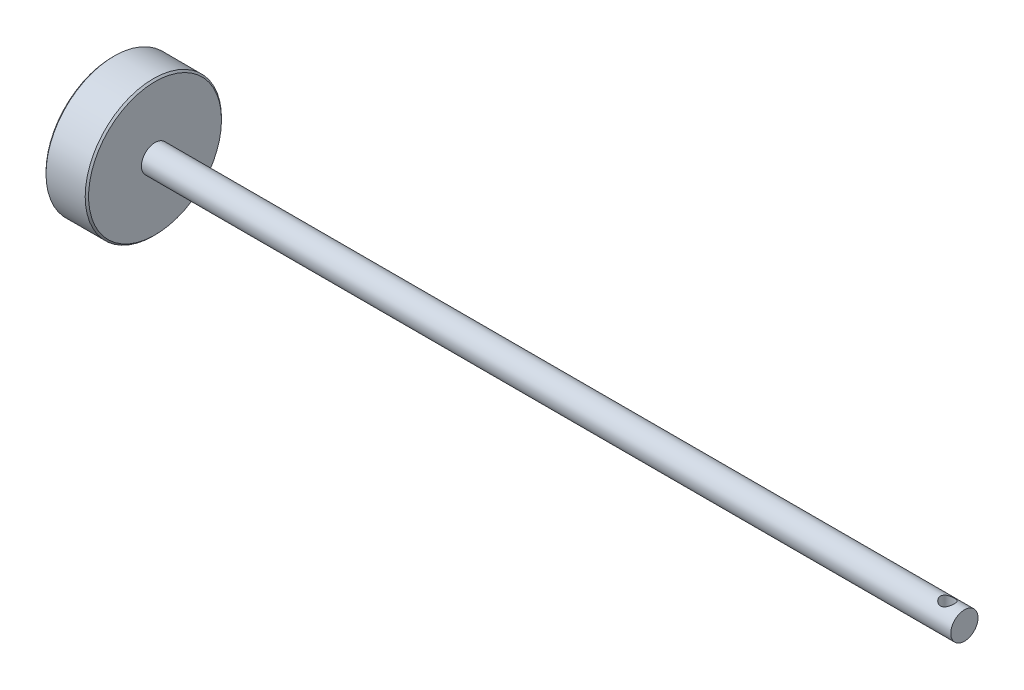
ISO-10303-21;
HEADER;
FILE_DESCRIPTION(('STEP AP214'),'2;1');
FILE_NAME('part.step','',(''),(''),'','','');
FILE_SCHEMA(('AUTOMOTIVE_DESIGN { 1 0 10303 214 1 1 1 1 }'));
ENDSEC;
DATA;
#1=APPLICATION_CONTEXT('core data for automotive mechanical design processes');
#2=APPLICATION_PROTOCOL_DEFINITION('international standard','automotive_design',2000,#1);
#3=PRODUCT_CONTEXT('',#1,'mechanical');
#4=PRODUCT('Part','Part','',(#3));
#5=PRODUCT_RELATED_PRODUCT_CATEGORY('part','',(#4));
#6=PRODUCT_DEFINITION_FORMATION('','',#4);
#7=PRODUCT_DEFINITION_CONTEXT('part definition',#1,'design');
#8=PRODUCT_DEFINITION('design','',#6,#7);
#9=PRODUCT_DEFINITION_SHAPE('','',#8);
#10=(LENGTH_UNIT() NAMED_UNIT(*) SI_UNIT(.MILLI.,.METRE.));
#11=(NAMED_UNIT(*) PLANE_ANGLE_UNIT() SI_UNIT($,.RADIAN.));
#12=(NAMED_UNIT(*) SI_UNIT($,.STERADIAN.) SOLID_ANGLE_UNIT());
#13=UNCERTAINTY_MEASURE_WITH_UNIT(LENGTH_MEASURE(1.E-05),#10,'distance_accuracy_value','');
#14=(GEOMETRIC_REPRESENTATION_CONTEXT(3) GLOBAL_UNCERTAINTY_ASSIGNED_CONTEXT((#13)) GLOBAL_UNIT_ASSIGNED_CONTEXT((#10,
#11,#12)) REPRESENTATION_CONTEXT('',''));
#15=CARTESIAN_POINT('',(0.,0.,0.));
#16=DIRECTION('',(0.,0.,1.));
#17=DIRECTION('',(1.,0.,0.));
#18=AXIS2_PLACEMENT_3D('',#15,#16,#17);
#19=CARTESIAN_POINT('',(-400.,8.,0.));
#20=DIRECTION('',(-1.,0.,0.));
#21=DIRECTION('',(0.,0.,1.));
#22=AXIS2_PLACEMENT_3D('',#19,#20,#21);
#23=CYLINDRICAL_SURFACE('',#22,8.);
#24=CARTESIAN_POINT('',(90.,1.0717967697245,-4.00000000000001));
#25=CARTESIAN_POINT('',(90.1042653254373,1.07179613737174,-3.99999950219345));
#26=CARTESIAN_POINT('',(90.2085399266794,1.06943488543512,-3.9959176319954));
#27=CARTESIAN_POINT('',(90.4162841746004,1.06007827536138,-3.97964472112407));
#28=CARTESIAN_POINT('',(90.5197534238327,1.05308075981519,-3.96744990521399));
#29=CARTESIAN_POINT('',(90.7252108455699,1.03469669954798,-3.93508538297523));
#30=CARTESIAN_POINT('',(90.8271964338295,1.02330327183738,-3.91490316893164));
#31=CARTESIAN_POINT('',(91.0288140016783,0.996540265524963,-3.86682062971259));
#32=CARTESIAN_POINT('',(91.1284449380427,0.981168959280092,-3.83891695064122));
#33=CARTESIAN_POINT('',(91.4216889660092,0.930034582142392,-3.74442772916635));
#34=CARTESIAN_POINT('',(91.610985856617,0.889120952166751,-3.66684915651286));
#35=CARTESIAN_POINT('',(91.973729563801,0.798290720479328,-3.4850607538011));
#36=CARTESIAN_POINT('',(92.1471755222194,0.74837363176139,-3.38084948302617));
#37=CARTESIAN_POINT('',(92.4892084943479,0.640127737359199,-3.13867639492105));
#38=CARTESIAN_POINT('',(92.6562148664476,0.581444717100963,-2.99863981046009));
#39=CARTESIAN_POINT('',(92.9656552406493,0.465113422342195,-2.69298354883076));
#40=CARTESIAN_POINT('',(93.1080769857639,0.407465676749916,-2.52735118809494));
#41=CARTESIAN_POINT('',(93.3049820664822,0.324124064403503,-2.25626437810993));
#42=CARTESIAN_POINT('',(93.3695322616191,0.296050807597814,-2.15870290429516));
#43=CARTESIAN_POINT('',(93.4901044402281,0.242558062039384,-1.95777427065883));
#44=CARTESIAN_POINT('',(93.5461300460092,0.217137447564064,-1.85440960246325));
#45=CARTESIAN_POINT('',(93.6491127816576,0.169678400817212,-1.64251485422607));
#46=CARTESIAN_POINT('',(93.6960700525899,0.147639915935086,-1.53398485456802));
#47=CARTESIAN_POINT('',(93.7803619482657,0.107613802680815,-1.31258580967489));
#48=CARTESIAN_POINT('',(93.8177019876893,0.0896238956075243,-1.19971924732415));
#49=CARTESIAN_POINT('',(93.8800182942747,0.0593542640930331,-0.978622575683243));
#50=CARTESIAN_POINT('',(93.9056821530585,0.0467606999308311,-0.870629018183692));
#51=CARTESIAN_POINT('',(93.9479797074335,0.0259041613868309,-0.652524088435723));
#52=CARTESIAN_POINT('',(93.9646178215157,0.0176390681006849,-0.54241377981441));
#53=CARTESIAN_POINT('',(93.9886558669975,0.00567284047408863,-0.320973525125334));
#54=CARTESIAN_POINT('',(93.9960584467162,0.00197039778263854,-0.209643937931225));
#55=CARTESIAN_POINT('',(94.00153168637,-0.000765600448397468,0.0132971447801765));
#56=CARTESIAN_POINT('',(93.9996029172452,0.000200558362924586,0.124908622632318));
#57=CARTESIAN_POINT('',(93.9870147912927,0.00648639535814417,0.337727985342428));
#58=CARTESIAN_POINT('',(93.9771319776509,0.0114188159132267,0.438993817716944));
#59=CARTESIAN_POINT('',(93.9497367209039,0.0250211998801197,0.64024324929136));
#60=CARTESIAN_POINT('',(93.9322218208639,0.0336923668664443,0.740226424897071));
#61=CARTESIAN_POINT('',(93.8684894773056,0.0650280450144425,1.0371413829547));
#62=CARTESIAN_POINT('',(93.8110721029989,0.0930212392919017,1.23123936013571));
#63=CARTESIAN_POINT('',(93.6676660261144,0.161137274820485,1.60926871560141));
#64=CARTESIAN_POINT('',(93.5812930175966,0.201422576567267,1.79302228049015));
#65=CARTESIAN_POINT('',(93.3829480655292,0.290493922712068,2.14389861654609));
#66=CARTESIAN_POINT('',(93.2709669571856,0.339283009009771,2.31101540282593));
#67=CARTESIAN_POINT('',(93.0124150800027,0.446224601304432,2.64069813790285));
#68=CARTESIAN_POINT('',(92.8635752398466,0.504826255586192,2.80134064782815));
#69=CARTESIAN_POINT('',(92.5416537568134,0.62182508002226,3.09641313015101));
#70=CARTESIAN_POINT('',(92.3685536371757,0.680222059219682,3.23082293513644));
#71=CARTESIAN_POINT('',(91.9893571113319,0.79423887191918,3.47803613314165));
#72=CARTESIAN_POINT('',(91.7818633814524,0.849446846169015,3.58892539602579));
#73=CARTESIAN_POINT('',(91.4565826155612,0.92113074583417,3.72723782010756));
#74=CARTESIAN_POINT('',(91.3457916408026,0.943174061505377,3.76867730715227));
#75=CARTESIAN_POINT('',(91.1202551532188,0.982687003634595,3.84175062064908));
#76=CARTESIAN_POINT('',(91.0055121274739,1.00015944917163,3.873390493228));
#77=CARTESIAN_POINT('',(90.7821713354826,1.02859397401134,3.92431909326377));
#78=CARTESIAN_POINT('',(90.6738013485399,1.03996042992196,3.94438433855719));
#79=CARTESIAN_POINT('',(90.4554190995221,1.05769664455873,3.97551851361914));
#80=CARTESIAN_POINT('',(90.3454077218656,1.06406900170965,3.98659212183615));
#81=CARTESIAN_POINT('',(90.1247074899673,1.07155188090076,3.9995829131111));
#82=CARTESIAN_POINT('',(90.0140189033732,1.07266436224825,4.00150350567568));
#83=CARTESIAN_POINT('',(89.7929433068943,1.06958460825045,3.99616718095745));
#84=CARTESIAN_POINT('',(89.6825562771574,1.06539273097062,3.9889108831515));
#85=CARTESIAN_POINT('',(89.4751306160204,1.05262802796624,3.96663154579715));
#86=CARTESIAN_POINT('',(89.3779567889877,1.04458658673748,3.9525484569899));
#87=CARTESIAN_POINT('',(89.1852680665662,1.02471627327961,3.91737385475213));
#88=CARTESIAN_POINT('',(89.0897537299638,1.01288615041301,3.89628002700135));
#89=CARTESIAN_POINT('',(88.8066319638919,0.972243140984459,3.82280238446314));
#90=CARTESIAN_POINT('',(88.6223085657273,0.938268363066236,3.76020731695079));
#91=CARTESIAN_POINT('',(88.2583254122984,0.858550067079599,3.60658595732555));
#92=CARTESIAN_POINT('',(88.079277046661,0.812334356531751,3.51437713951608));
#93=CARTESIAN_POINT('',(87.7381298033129,0.713755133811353,3.30514737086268));
#94=CARTESIAN_POINT('',(87.5760396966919,0.661388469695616,3.18811367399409));
#95=CARTESIAN_POINT('',(87.2520868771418,0.548481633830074,2.91535761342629));
#96=CARTESIAN_POINT('',(87.0928284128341,0.487743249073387,2.75661800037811));
#97=CARTESIAN_POINT('',(86.8023340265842,0.370624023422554,2.41358105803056));
#98=CARTESIAN_POINT('',(86.6711075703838,0.314244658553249,2.229275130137));
#99=CARTESIAN_POINT('',(86.4967922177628,0.236644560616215,1.93419225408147));
#100=CARTESIAN_POINT('',(86.4418699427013,0.211656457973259,1.83122945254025));
#101=CARTESIAN_POINT('',(86.3409944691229,0.165058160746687,1.62028527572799));
#102=CARTESIAN_POINT('',(86.2950372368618,0.143446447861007,1.51230618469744));
#103=CARTESIAN_POINT('',(86.2126256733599,0.104248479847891,1.29213403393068));
#104=CARTESIAN_POINT('',(86.1761668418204,0.0866603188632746,1.17994299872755));
#105=CARTESIAN_POINT('',(86.1131927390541,0.0560392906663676,0.952197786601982));
#106=CARTESIAN_POINT('',(86.0866762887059,0.0430058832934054,0.836644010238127));
#107=CARTESIAN_POINT('',(86.0459279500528,0.0228825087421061,0.613942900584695));
#108=CARTESIAN_POINT('',(86.0307905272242,0.0153561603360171,0.506999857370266));
#109=CARTESIAN_POINT('',(86.0092078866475,0.00460550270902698,0.291983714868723));
#110=CARTESIAN_POINT('',(86.002765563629,0.00138262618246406,0.183910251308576));
#111=CARTESIAN_POINT('',(85.9986698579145,-0.000664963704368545,-0.0323692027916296));
#112=CARTESIAN_POINT('',(86.0010103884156,0.000507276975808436,-0.140575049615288));
#113=CARTESIAN_POINT('',(86.014437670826,0.00721115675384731,-0.356345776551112));
#114=CARTESIAN_POINT('',(86.0255276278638,0.012744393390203,-0.463910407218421));
#115=CARTESIAN_POINT('',(86.0552939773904,0.0275129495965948,-0.670402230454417));
#116=CARTESIAN_POINT('',(86.0734178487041,0.036478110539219,-0.769428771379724));
#117=CARTESIAN_POINT('',(86.1169699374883,0.0578611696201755,-0.965494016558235));
#118=CARTESIAN_POINT('',(86.142400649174,0.0702802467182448,-1.06253202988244));
#119=CARTESIAN_POINT('',(86.2292865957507,0.112309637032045,-1.34967669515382));
#120=CARTESIAN_POINT('',(86.30136154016,0.146705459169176,-1.535990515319));
#121=CARTESIAN_POINT('',(86.4749137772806,0.226964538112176,-1.90172389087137));
#122=CARTESIAN_POINT('',(86.5775167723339,0.273255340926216,-2.08050775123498));
#123=CARTESIAN_POINT('',(86.8078322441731,0.372474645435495,-2.41909138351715));
#124=CARTESIAN_POINT('',(86.9355562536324,0.425406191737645,-2.57888238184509));
#125=CARTESIAN_POINT('',(87.227180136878,0.538853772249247,-2.8916543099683));
#126=CARTESIAN_POINT('',(87.393415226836,0.599600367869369,-3.04237488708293));
#127=CARTESIAN_POINT('',(87.7498376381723,0.71748463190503,-3.31466901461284));
#128=CARTESIAN_POINT('',(87.9400459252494,0.774619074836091,-3.43621677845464));
#129=CARTESIAN_POINT('',(88.2433757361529,0.853269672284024,-3.59554085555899));
#130=CARTESIAN_POINT('',(88.3493010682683,0.878650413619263,-3.64540546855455));
#131=CARTESIAN_POINT('',(88.5658043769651,0.925696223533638,-3.7358834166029));
#132=CARTESIAN_POINT('',(88.6763799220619,0.947363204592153,-3.77650151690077));
#133=CARTESIAN_POINT('',(88.9011262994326,0.986063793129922,-3.8479016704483));
#134=CARTESIAN_POINT('',(89.015287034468,1.00310930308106,-3.87870902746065));
#135=CARTESIAN_POINT('',(89.2464737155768,1.03188172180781,-3.93016568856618));
#136=CARTESIAN_POINT('',(89.3634975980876,1.04361234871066,-3.95082209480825));
#137=CARTESIAN_POINT('',(89.5671983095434,1.05881967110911,-3.97745846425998));
#138=CARTESIAN_POINT('',(89.6534593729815,1.06367424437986,-3.98590343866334));
#139=CARTESIAN_POINT('',(89.8264781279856,1.07016316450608,-3.99717460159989));
#140=CARTESIAN_POINT('',(89.9132358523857,1.07179729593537,-4.00000041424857));
#141=CARTESIAN_POINT('',(90.,1.0717967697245,-4.00000000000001));
#142=B_SPLINE_CURVE_WITH_KNOTS('',3,(#24,#25,#26,#27,#28,#29,#30,#31,#32,#33,#34,#35,#36,#37,
#38,#39,#40,#41,#42,#43,#44,#45,#46,#47,#48,#49,#50,#51,#52,#53,#54,#55,#56,#57,#58,#59,#60,#61,
#62,#63,#64,#65,#66,#67,#68,#69,#70,#71,#72,#73,#74,#75,#76,#77,#78,#79,#80,#81,#82,#83,#84,#85,
#86,#87,#88,#89,#90,#91,#92,#93,#94,#95,#96,#97,#98,#99,#100,#101,#102,#103,#104,#105,#106,#107,
#108,#109,#110,#111,#112,#113,#114,#115,#116,#117,#118,#119,#120,#121,#122,#123,#124,#125,#126,
#127,#128,#129,#130,#131,#132,#133,#134,#135,#136,#137,#138,#139,#140,#141),.UNSPECIFIED.,.T.,
.F.,(4,2,2,2,2,2,2,2,2,2,2,2,2,2,2,2,2,2,2,2,2,2,2,2,2,2,2,2,2,2,2,2,2,2,2,2,2,2,2,2,2,2,2,2,2,
2,2,2,2,2,2,2,2,2,2,2,2,2,4),(0.,0.312705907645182,0.625557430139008,0.938900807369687,
1.25238050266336,1.8753233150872,2.49829983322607,3.1726581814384,3.84735177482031,
4.20786878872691,4.56823217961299,4.92858996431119,5.28874441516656,5.62343001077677,
5.95795161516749,6.29237727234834,6.62678246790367,6.93200651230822,7.2373288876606,
7.84737748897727,8.46586637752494,9.08457696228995,9.76177264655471,10.4394869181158,
11.160238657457,11.5207615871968,11.8810616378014,12.212984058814,12.5447336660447,
12.8763596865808,13.2079633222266,13.5031682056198,13.7984706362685,14.38866539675,
15.006195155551,15.6240427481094,16.319773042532,17.0157378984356,17.3733524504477,
17.7308057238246,18.0880893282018,18.4453305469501,18.7697157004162,19.0942088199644,
19.4184770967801,19.7428642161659,20.0457160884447,20.3486714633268,20.9540518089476,
21.585324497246,22.2168876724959,22.9113041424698,23.6063321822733,23.9652997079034,
24.3240818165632,24.6819309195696,25.0395292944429,25.2997293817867,25.5599468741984),.UNSPECIFIED.);
#143=CARTESIAN_POINT('',(90.,1.0717967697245,-4.00000000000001));
#144=VERTEX_POINT('',#143);
#145=EDGE_CURVE('E68',#144,#144,#142,.T.);
#146=ORIENTED_EDGE('',*,*,#145,.F.);
#147=EDGE_LOOP('',(#146));
#148=FACE_BOUND('',#147,.T.);
#149=CARTESIAN_POINT('',(100.,8.,0.));
#150=DIRECTION('',(-1.,0.,0.));
#151=DIRECTION('',(0.,0.,1.));
#152=AXIS2_PLACEMENT_3D('',#149,#150,#151);
#153=CIRCLE('',#152,8.);
#154=CARTESIAN_POINT('',(100.,8.,8.));
#155=VERTEX_POINT('',#154);
#156=EDGE_CURVE('E58',#155,#155,#153,.T.);
#157=ORIENTED_EDGE('',*,*,#156,.T.);
#158=EDGE_LOOP('',(#157));
#159=FACE_BOUND('',#158,.T.);
#160=CARTESIAN_POINT('',(-375.,8.,0.));
#161=DIRECTION('',(-1.,0.,0.));
#162=DIRECTION('',(0.,0.,1.));
#163=AXIS2_PLACEMENT_3D('',#160,#161,#162);
#164=CIRCLE('',#163,8.);
#165=CARTESIAN_POINT('',(-375.,8.,8.));
#166=VERTEX_POINT('',#165);
#167=EDGE_CURVE('E63',#166,#166,#164,.T.);
#168=ORIENTED_EDGE('',*,*,#167,.F.);
#169=EDGE_LOOP('',(#168));
#170=FACE_BOUND('',#169,.T.);
#171=CARTESIAN_POINT('',(90.,14.9282032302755,-4.00000000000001));
#172=CARTESIAN_POINT('',(89.8957346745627,14.9282038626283,-3.99999950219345));
#173=CARTESIAN_POINT('',(89.7914600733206,14.9305651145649,-3.9959176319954));
#174=CARTESIAN_POINT('',(89.5837158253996,14.9399217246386,-3.97964472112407));
#175=CARTESIAN_POINT('',(89.4802465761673,14.9469192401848,-3.96744990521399));
#176=CARTESIAN_POINT('',(89.2747891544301,14.965303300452,-3.93508538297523));
#177=CARTESIAN_POINT('',(89.1728035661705,14.9766967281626,-3.91490316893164));
#178=CARTESIAN_POINT('',(88.9711859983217,15.003459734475,-3.86682062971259));
#179=CARTESIAN_POINT('',(88.8715550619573,15.0188310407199,-3.83891695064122));
#180=CARTESIAN_POINT('',(88.5783110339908,15.0699654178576,-3.74442772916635));
#181=CARTESIAN_POINT('',(88.389014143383,15.1108790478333,-3.66684915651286));
#182=CARTESIAN_POINT('',(88.026270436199,15.2017092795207,-3.4850607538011));
#183=CARTESIAN_POINT('',(87.8528244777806,15.2516263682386,-3.38084948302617));
#184=CARTESIAN_POINT('',(87.5107915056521,15.3598722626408,-3.13867639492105));
#185=CARTESIAN_POINT('',(87.3437851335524,15.418555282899,-2.99863981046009));
#186=CARTESIAN_POINT('',(87.0343447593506,15.5348865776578,-2.69298354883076));
#187=CARTESIAN_POINT('',(86.8919230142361,15.5925343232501,-2.52735118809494));
#188=CARTESIAN_POINT('',(86.6950179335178,15.6758759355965,-2.25626437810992));
#189=CARTESIAN_POINT('',(86.6304677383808,15.7039491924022,-2.15870290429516));
#190=CARTESIAN_POINT('',(86.5098955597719,15.7574419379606,-1.95777427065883));
#191=CARTESIAN_POINT('',(86.4538699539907,15.7828625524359,-1.85440960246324));
#192=CARTESIAN_POINT('',(86.3508872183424,15.8303215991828,-1.64251485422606));
#193=CARTESIAN_POINT('',(86.3039299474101,15.8523600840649,-1.53398485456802));
#194=CARTESIAN_POINT('',(86.2196380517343,15.8923861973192,-1.31258580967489));
#195=CARTESIAN_POINT('',(86.1822980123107,15.9103761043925,-1.19971924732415));
#196=CARTESIAN_POINT('',(86.1199817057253,15.940645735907,-0.978622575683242));
#197=CARTESIAN_POINT('',(86.0943178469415,15.9532393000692,-0.870629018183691));
#198=CARTESIAN_POINT('',(86.0520202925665,15.9740958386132,-0.652524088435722));
#199=CARTESIAN_POINT('',(86.0353821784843,15.9823609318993,-0.542413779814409));
#200=CARTESIAN_POINT('',(86.0113441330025,15.9943271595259,-0.320973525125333));
#201=CARTESIAN_POINT('',(86.0039415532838,15.9980296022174,-0.209643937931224));
#202=CARTESIAN_POINT('',(85.99846831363,16.0007656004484,0.0132971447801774));
#203=CARTESIAN_POINT('',(86.0003970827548,15.9997994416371,0.124908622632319));
#204=CARTESIAN_POINT('',(86.0129852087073,15.9935136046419,0.337727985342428));
#205=CARTESIAN_POINT('',(86.0228680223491,15.9885811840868,0.438993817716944));
#206=CARTESIAN_POINT('',(86.0502632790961,15.9749788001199,0.64024324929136));
#207=CARTESIAN_POINT('',(86.0677781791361,15.9663076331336,0.740226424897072));
#208=CARTESIAN_POINT('',(86.1315105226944,15.9349719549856,1.0371413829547));
#209=CARTESIAN_POINT('',(86.1889278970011,15.9069787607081,1.23123936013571));
#210=CARTESIAN_POINT('',(86.3323339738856,15.8388627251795,1.60926871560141));
#211=CARTESIAN_POINT('',(86.4187069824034,15.7985774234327,1.79302228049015));
#212=CARTESIAN_POINT('',(86.6170519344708,15.7095060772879,2.14389861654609));
#213=CARTESIAN_POINT('',(86.7290330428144,15.6607169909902,2.31101540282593));
#214=CARTESIAN_POINT('',(86.9875849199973,15.5537753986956,2.64069813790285));
#215=CARTESIAN_POINT('',(87.1364247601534,15.4951737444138,2.80134064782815));
#216=CARTESIAN_POINT('',(87.4583462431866,15.3781749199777,3.09641313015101));
#217=CARTESIAN_POINT('',(87.6314463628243,15.3197779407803,3.23082293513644));
#218=CARTESIAN_POINT('',(88.0106428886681,15.2057611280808,3.47803613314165));
#219=CARTESIAN_POINT('',(88.2181366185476,15.150553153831,3.58892539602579));
#220=CARTESIAN_POINT('',(88.5434173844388,15.0788692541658,3.72723782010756));
#221=CARTESIAN_POINT('',(88.6542083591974,15.0568259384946,3.76867730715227));
#222=CARTESIAN_POINT('',(88.8797448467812,15.0173129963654,3.84175062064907));
#223=CARTESIAN_POINT('',(88.9944878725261,14.9998405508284,3.873390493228));
#224=CARTESIAN_POINT('',(89.2178286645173,14.9714060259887,3.92431909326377));
#225=CARTESIAN_POINT('',(89.32619865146,14.960039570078,3.94438433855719));
#226=CARTESIAN_POINT('',(89.5445809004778,14.9423033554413,3.97551851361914));
#227=CARTESIAN_POINT('',(89.6545922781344,14.9359309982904,3.98659212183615));
#228=CARTESIAN_POINT('',(89.8752925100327,14.9284481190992,3.99958291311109));
#229=CARTESIAN_POINT('',(89.9859810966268,14.9273356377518,4.00150350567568));
#230=CARTESIAN_POINT('',(90.2070566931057,14.9304153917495,3.99616718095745));
#231=CARTESIAN_POINT('',(90.3174437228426,14.9346072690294,3.9889108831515));
#232=CARTESIAN_POINT('',(90.5248693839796,14.9473719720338,3.96663154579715));
#233=CARTESIAN_POINT('',(90.6220432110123,14.9554134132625,3.9525484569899));
#234=CARTESIAN_POINT('',(90.8147319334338,14.9752837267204,3.91737385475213));
#235=CARTESIAN_POINT('',(90.9102462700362,14.987113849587,3.89628002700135));
#236=CARTESIAN_POINT('',(91.1933680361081,15.0277568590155,3.82280238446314));
#237=CARTESIAN_POINT('',(91.3776914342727,15.0617316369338,3.76020731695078));
#238=CARTESIAN_POINT('',(91.7416745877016,15.1414499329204,3.60658595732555));
#239=CARTESIAN_POINT('',(91.920722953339,15.1876656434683,3.51437713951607));
#240=CARTESIAN_POINT('',(92.2618701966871,15.2862448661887,3.30514737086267));
#241=CARTESIAN_POINT('',(92.4239603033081,15.3386115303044,3.18811367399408));
#242=CARTESIAN_POINT('',(92.7479131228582,15.4515183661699,2.91535761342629));
#243=CARTESIAN_POINT('',(92.9071715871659,15.5122567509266,2.7566180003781));
#244=CARTESIAN_POINT('',(93.1976659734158,15.6293759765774,2.41358105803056));
#245=CARTESIAN_POINT('',(93.3288924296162,15.6857553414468,2.22927513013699));
#246=CARTESIAN_POINT('',(93.5032077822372,15.7633554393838,1.93419225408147));
#247=CARTESIAN_POINT('',(93.5581300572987,15.7883435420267,1.83122945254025));
#248=CARTESIAN_POINT('',(93.659005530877,15.8349418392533,1.62028527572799));
#249=CARTESIAN_POINT('',(93.7049627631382,15.856553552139,1.51230618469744));
#250=CARTESIAN_POINT('',(93.7873743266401,15.8957515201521,1.29213403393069));
#251=CARTESIAN_POINT('',(93.8238331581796,15.9133396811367,1.17994299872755));
#252=CARTESIAN_POINT('',(93.8868072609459,15.9439607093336,0.952197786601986));
#253=CARTESIAN_POINT('',(93.9133237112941,15.9569941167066,0.836644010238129));
#254=CARTESIAN_POINT('',(93.9540720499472,15.9771174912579,0.613942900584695));
#255=CARTESIAN_POINT('',(93.9692094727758,15.984643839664,0.506999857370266));
#256=CARTESIAN_POINT('',(93.9907921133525,15.995394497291,0.291983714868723));
#257=CARTESIAN_POINT('',(93.997234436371,15.9986173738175,0.183910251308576));
#258=CARTESIAN_POINT('',(94.0013301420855,16.0006649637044,-0.0323692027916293));
#259=CARTESIAN_POINT('',(93.9989896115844,15.9994927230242,-0.140575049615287));
#260=CARTESIAN_POINT('',(93.985562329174,15.9927888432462,-0.356345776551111));
#261=CARTESIAN_POINT('',(93.9744723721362,15.9872556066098,-0.463910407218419));
#262=CARTESIAN_POINT('',(93.9447060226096,15.9724870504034,-0.670402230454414));
#263=CARTESIAN_POINT('',(93.9265821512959,15.9635218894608,-0.769428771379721));
#264=CARTESIAN_POINT('',(93.8830300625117,15.9421388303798,-0.965494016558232));
#265=CARTESIAN_POINT('',(93.857599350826,15.9297197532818,-1.06253202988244));
#266=CARTESIAN_POINT('',(93.7707134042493,15.887690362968,-1.34967669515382));
#267=CARTESIAN_POINT('',(93.69863845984,15.8532945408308,-1.535990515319));
#268=CARTESIAN_POINT('',(93.5250862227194,15.7730354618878,-1.90172389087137));
#269=CARTESIAN_POINT('',(93.422483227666,15.7267446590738,-2.08050775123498));
#270=CARTESIAN_POINT('',(93.1921677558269,15.6275253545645,-2.41909138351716));
#271=CARTESIAN_POINT('',(93.0644437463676,15.5745938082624,-2.57888238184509));
#272=CARTESIAN_POINT('',(92.772819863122,15.4611462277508,-2.8916543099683));
#273=CARTESIAN_POINT('',(92.606584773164,15.4003996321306,-3.04237488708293));
#274=CARTESIAN_POINT('',(92.2501623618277,15.282515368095,-3.31466901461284));
#275=CARTESIAN_POINT('',(92.0599540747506,15.2253809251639,-3.43621677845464));
#276=CARTESIAN_POINT('',(91.756624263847,15.146730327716,-3.59554085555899));
#277=CARTESIAN_POINT('',(91.6506989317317,15.1213495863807,-3.64540546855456));
#278=CARTESIAN_POINT('',(91.4341956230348,15.0743037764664,-3.73588341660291));
#279=CARTESIAN_POINT('',(91.3236200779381,15.0526367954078,-3.77650151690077));
#280=CARTESIAN_POINT('',(91.0988737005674,15.0139362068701,-3.8479016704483));
#281=CARTESIAN_POINT('',(90.984712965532,14.9968906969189,-3.87870902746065));
#282=CARTESIAN_POINT('',(90.7535262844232,14.9681182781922,-3.93016568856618));
#283=CARTESIAN_POINT('',(90.6365024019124,14.9563876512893,-3.95082209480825));
#284=CARTESIAN_POINT('',(90.4328016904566,14.9411803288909,-3.97745846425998));
#285=CARTESIAN_POINT('',(90.3465406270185,14.9363257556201,-3.98590343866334));
#286=CARTESIAN_POINT('',(90.1735218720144,14.9298368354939,-3.99717460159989));
#287=CARTESIAN_POINT('',(90.0867641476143,14.9282027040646,-4.00000041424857));
#288=CARTESIAN_POINT('',(90.,14.9282032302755,-4.00000000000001));
#289=B_SPLINE_CURVE_WITH_KNOTS('',3,(#171,#172,#173,#174,#175,#176,#177,#178,#179,#180,#181,
#182,#183,#184,#185,#186,#187,#188,#189,#190,#191,#192,#193,#194,#195,#196,#197,#198,#199,#200,
#201,#202,#203,#204,#205,#206,#207,#208,#209,#210,#211,#212,#213,#214,#215,#216,#217,#218,#219,
#220,#221,#222,#223,#224,#225,#226,#227,#228,#229,#230,#231,#232,#233,#234,#235,#236,#237,#238,
#239,#240,#241,#242,#243,#244,#245,#246,#247,#248,#249,#250,#251,#252,#253,#254,#255,#256,#257,
#258,#259,#260,#261,#262,#263,#264,#265,#266,#267,#268,#269,#270,#271,#272,#273,#274,#275,#276,
#277,#278,#279,#280,#281,#282,#283,#284,#285,#286,#287,#288),.UNSPECIFIED.,.T.,.F.,(4,2,2,2,2,2,
2,2,2,2,2,2,2,2,2,2,2,2,2,2,2,2,2,2,2,2,2,2,2,2,2,2,2,2,2,2,2,2,2,2,2,2,2,2,2,2,2,2,2,2,2,2,2,2,
2,2,2,2,4),(0.,0.312705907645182,0.625557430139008,0.938900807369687,1.25238050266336,
1.8753233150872,2.49829983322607,3.1726581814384,3.84735177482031,4.20786878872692,
4.568232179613,4.92858996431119,5.28874441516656,5.62343001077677,5.95795161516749,
6.29237727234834,6.62678246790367,6.93200651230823,7.23732888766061,7.84737748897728,
8.46586637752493,9.08457696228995,9.76177264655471,10.4394869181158,11.160238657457,
11.5207615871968,11.8810616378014,12.212984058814,12.5447336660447,12.8763596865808,
13.2079633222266,13.5031682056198,13.7984706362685,14.3886653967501,15.006195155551,
15.6240427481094,16.319773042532,17.0157378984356,17.3733524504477,17.7308057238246,
18.0880893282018,18.4453305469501,18.7697157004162,19.0942088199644,19.4184770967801,
19.7428642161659,20.0457160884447,20.3486714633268,20.9540518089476,21.585324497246,
22.2168876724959,22.9113041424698,23.6063321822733,23.9652997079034,24.3240818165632,
24.6819309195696,25.0395292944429,25.2997293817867,25.5599468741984),.UNSPECIFIED.);
#290=CARTESIAN_POINT('',(90.,14.9282032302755,-4.00000000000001));
#291=VERTEX_POINT('',#290);
#292=EDGE_CURVE('E67',#291,#291,#289,.T.);
#293=ORIENTED_EDGE('',*,*,#292,.F.);
#294=EDGE_LOOP('',(#293));
#295=FACE_BOUND('',#294,.T.);
#296=ADVANCED_FACE('F39',(#148,#159,#170,#295),#23,.T.);
#297=CARTESIAN_POINT('',(100.,0.,0.));
#298=DIRECTION('',(1.,0.,0.));
#299=DIRECTION('',(0.,0.,-1.));
#300=AXIS2_PLACEMENT_3D('',#297,#298,#299);
#301=PLANE('',#300);
#302=ORIENTED_EDGE('',*,*,#156,.F.);
#303=EDGE_LOOP('',(#302));
#304=FACE_BOUND('',#303,.T.);
#305=ADVANCED_FACE('F93',(#304),#301,.T.);
#306=CARTESIAN_POINT('',(-375.,0.,0.));
#307=DIRECTION('',(1.,0.,0.));
#308=DIRECTION('',(0.,0.,-1.));
#309=AXIS2_PLACEMENT_3D('',#306,#307,#308);
#310=PLANE('',#309);
#311=CARTESIAN_POINT('',(-375.,8.,0.));
#312=DIRECTION('',(1.,0.,0.));
#313=DIRECTION('',(0.,0.,-1.));
#314=AXIS2_PLACEMENT_3D('',#311,#312,#313);
#315=CIRCLE('',#314,39.);
#316=CARTESIAN_POINT('',(-375.,8.,-39.));
#317=VERTEX_POINT('',#316);
#318=EDGE_CURVE('E46',#317,#317,#315,.T.);
#319=ORIENTED_EDGE('',*,*,#318,.T.);
#320=EDGE_LOOP('',(#319));
#321=FACE_BOUND('',#320,.T.);
#322=ORIENTED_EDGE('',*,*,#167,.T.);
#323=EDGE_LOOP('',(#322));
#324=FACE_BOUND('',#323,.T.);
#325=ADVANCED_FACE('F89',(#321,#324),#310,.T.);
#326=CARTESIAN_POINT('',(-400.,8.,0.));
#327=DIRECTION('',(-1.,0.,0.));
#328=DIRECTION('',(0.,0.,1.));
#329=AXIS2_PLACEMENT_3D('',#326,#327,#328);
#330=CYLINDRICAL_SURFACE('',#329,40.);
#331=CARTESIAN_POINT('',(-376.,8.,0.));
#332=DIRECTION('',(1.,0.,0.));
#333=DIRECTION('',(0.,0.,-1.));
#334=AXIS2_PLACEMENT_3D('',#331,#332,#333);
#335=CIRCLE('',#334,40.);
#336=CARTESIAN_POINT('',(-376.,8.,-40.));
#337=VERTEX_POINT('',#336);
#338=EDGE_CURVE('E50',#337,#337,#335,.F.);
#339=ORIENTED_EDGE('',*,*,#338,.T.);
#340=EDGE_LOOP('',(#339));
#341=FACE_BOUND('',#340,.T.);
#342=CARTESIAN_POINT('',(-399.,8.,0.));
#343=DIRECTION('',(-1.,0.,0.));
#344=DIRECTION('',(0.,0.,1.));
#345=AXIS2_PLACEMENT_3D('',#342,#343,#344);
#346=CIRCLE('',#345,40.);
#347=CARTESIAN_POINT('',(-399.,8.,40.));
#348=VERTEX_POINT('',#347);
#349=EDGE_CURVE('E54',#348,#348,#346,.F.);
#350=ORIENTED_EDGE('',*,*,#349,.T.);
#351=EDGE_LOOP('',(#350));
#352=FACE_BOUND('',#351,.T.);
#353=ADVANCED_FACE('F86',(#341,#352),#330,.T.);
#354=CARTESIAN_POINT('',(-400.,8.,0.));
#355=DIRECTION('',(-1.,0.,0.));
#356=DIRECTION('',(0.,0.,1.));
#357=AXIS2_PLACEMENT_3D('',#354,#355,#356);
#358=PLANE('',#357);
#359=CARTESIAN_POINT('',(-400.,8.,0.));
#360=DIRECTION('',(-1.,0.,0.));
#361=DIRECTION('',(0.,0.,1.));
#362=AXIS2_PLACEMENT_3D('',#359,#360,#361);
#363=CIRCLE('',#362,39.);
#364=CARTESIAN_POINT('',(-400.,8.,39.));
#365=VERTEX_POINT('',#364);
#366=EDGE_CURVE('E11',#365,#365,#363,.T.);
#367=ORIENTED_EDGE('',*,*,#366,.T.);
#368=EDGE_LOOP('',(#367));
#369=FACE_BOUND('',#368,.T.);
#370=ADVANCED_FACE('F81',(#369),#358,.T.);
#371=CARTESIAN_POINT('',(-376.,8.,0.));
#372=DIRECTION('',(-1.,0.,0.));
#373=DIRECTION('',(0.,0.,1.));
#374=AXIS2_PLACEMENT_3D('',#371,#372,#373);
#375=CONICAL_SURFACE('',#374,40.,0.785398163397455);
#376=ORIENTED_EDGE('',*,*,#318,.F.);
#377=EDGE_LOOP('',(#376));
#378=FACE_BOUND('',#377,.T.);
#379=ORIENTED_EDGE('',*,*,#338,.F.);
#380=EDGE_LOOP('',(#379));
#381=FACE_BOUND('',#380,.T.);
#382=ADVANCED_FACE('F85',(#378,#381),#375,.T.);
#383=CARTESIAN_POINT('',(-400.,8.,0.));
#384=DIRECTION('',(1.,0.,0.));
#385=DIRECTION('',(0.,0.,-1.));
#386=AXIS2_PLACEMENT_3D('',#383,#384,#385);
#387=CONICAL_SURFACE('',#386,39.,0.785398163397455);
#388=ORIENTED_EDGE('',*,*,#349,.F.);
#389=EDGE_LOOP('',(#388));
#390=FACE_BOUND('',#389,.T.);
#391=ORIENTED_EDGE('',*,*,#366,.F.);
#392=EDGE_LOOP('',(#391));
#393=FACE_BOUND('',#392,.T.);
#394=ADVANCED_FACE('F41',(#390,#393),#387,.T.);
#395=CARTESIAN_POINT('',(90.,48.001,0.));
#396=DIRECTION('',(0.,-1.,0.));
#397=DIRECTION('',(0.,0.,-1.));
#398=AXIS2_PLACEMENT_3D('',#395,#396,#397);
#399=CYLINDRICAL_SURFACE('',#398,4.00000000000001);
#400=ORIENTED_EDGE('',*,*,#292,.T.);
#401=EDGE_LOOP('',(#400));
#402=FACE_BOUND('',#401,.T.);
#403=ORIENTED_EDGE('',*,*,#145,.T.);
#404=EDGE_LOOP('',(#403));
#405=FACE_BOUND('',#404,.T.);
#406=ADVANCED_FACE('F77',(#402,#405),#399,.F.);
#407=CLOSED_SHELL('',(#296,#305,#325,#353,#370,#382,#394,#406));
#408=MANIFOLD_SOLID_BREP('B2',#407);
#409=ADVANCED_BREP_SHAPE_REPRESENTATION('',(#18,#408),#14);
#410=SHAPE_DEFINITION_REPRESENTATION(#9,#409);
ENDSEC;
END-ISO-10303-21;
